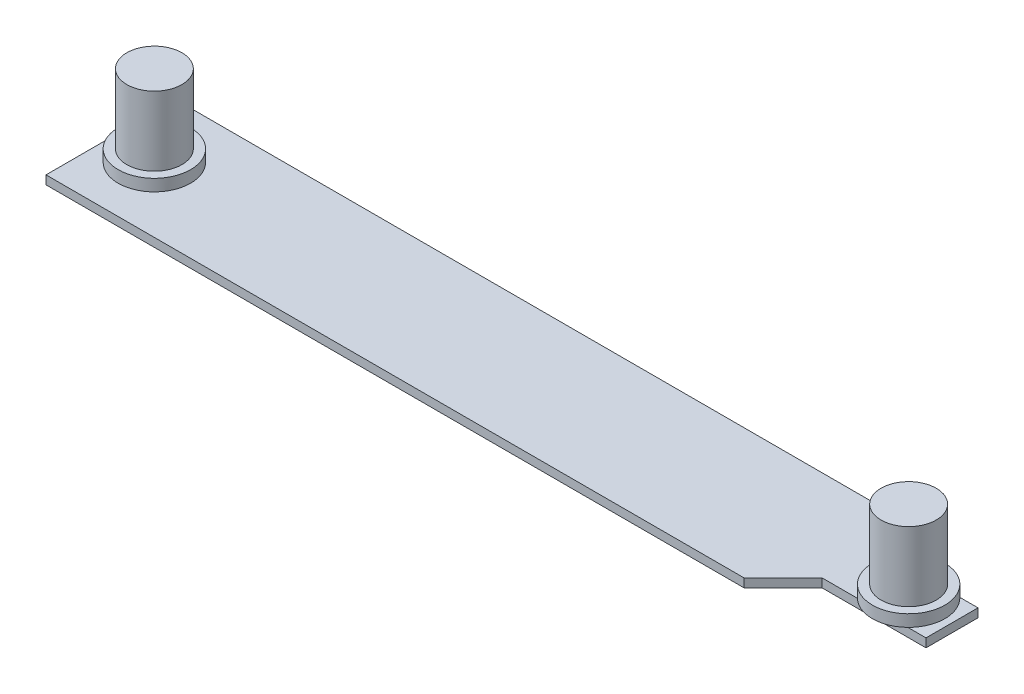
ISO-10303-21;
HEADER;
FILE_DESCRIPTION(('STEP AP214'),'2;1');
FILE_NAME('part.step','',(''),(''),'','','');
FILE_SCHEMA(('AUTOMOTIVE_DESIGN { 1 0 10303 214 1 1 1 1 }'));
ENDSEC;
DATA;
#1=APPLICATION_CONTEXT('core data for automotive mechanical design processes');
#2=APPLICATION_PROTOCOL_DEFINITION('international standard','automotive_design',2000,#1);
#3=PRODUCT_CONTEXT('',#1,'mechanical');
#4=PRODUCT('Part','Part','',(#3));
#5=PRODUCT_RELATED_PRODUCT_CATEGORY('part','',(#4));
#6=PRODUCT_DEFINITION_FORMATION('','',#4);
#7=PRODUCT_DEFINITION_CONTEXT('part definition',#1,'design');
#8=PRODUCT_DEFINITION('design','',#6,#7);
#9=PRODUCT_DEFINITION_SHAPE('','',#8);
#10=(LENGTH_UNIT() NAMED_UNIT(*) SI_UNIT(.MILLI.,.METRE.));
#11=(NAMED_UNIT(*) PLANE_ANGLE_UNIT() SI_UNIT($,.RADIAN.));
#12=(NAMED_UNIT(*) SI_UNIT($,.STERADIAN.) SOLID_ANGLE_UNIT());
#13=UNCERTAINTY_MEASURE_WITH_UNIT(LENGTH_MEASURE(1.E-05),#10,'distance_accuracy_value','');
#14=(GEOMETRIC_REPRESENTATION_CONTEXT(3) GLOBAL_UNCERTAINTY_ASSIGNED_CONTEXT((#13)) GLOBAL_UNIT_ASSIGNED_CONTEXT((#10,
#11,#12)) REPRESENTATION_CONTEXT('',''));
#15=CARTESIAN_POINT('',(0.,0.,0.));
#16=DIRECTION('',(0.,0.,1.));
#17=DIRECTION('',(1.,0.,0.));
#18=AXIS2_PLACEMENT_3D('',#15,#16,#17);
#19=CARTESIAN_POINT('',(43.5,2.36,0.));
#20=DIRECTION('',(0.,1.,0.));
#21=DIRECTION('',(0.,0.,1.));
#22=AXIS2_PLACEMENT_3D('',#19,#20,#21);
#23=PLANE('',#22);
#24=CARTESIAN_POINT('',(43.5,2.36,0.));
#25=DIRECTION('',(0.,1.,0.));
#26=DIRECTION('',(0.,0.,1.));
#27=AXIS2_PLACEMENT_3D('',#24,#25,#26);
#28=CIRCLE('',#27,4.18);
#29=CARTESIAN_POINT('',(43.5,2.36,4.18));
#30=VERTEX_POINT('',#29);
#31=EDGE_CURVE('E139',#30,#30,#28,.T.);
#32=ORIENTED_EDGE('',*,*,#31,.T.);
#33=EDGE_LOOP('',(#32));
#34=FACE_BOUND('',#33,.T.);
#35=CARTESIAN_POINT('',(43.5,2.36,0.));
#36=DIRECTION('',(0.,1.,0.));
#37=DIRECTION('',(0.,0.,1.));
#38=AXIS2_PLACEMENT_3D('',#35,#36,#37);
#39=CIRCLE('',#38,3.18);
#40=CARTESIAN_POINT('',(43.5,2.36,3.18));
#41=VERTEX_POINT('',#40);
#42=EDGE_CURVE('E226',#41,#41,#39,.T.);
#43=ORIENTED_EDGE('',*,*,#42,.F.);
#44=EDGE_LOOP('',(#43));
#45=FACE_BOUND('',#44,.T.);
#46=ADVANCED_FACE('F33',(#34,#45),#23,.T.);
#47=CARTESIAN_POINT('',(-43.5,2.36,0.));
#48=DIRECTION('',(0.,1.,0.));
#49=DIRECTION('',(0.,0.,1.));
#50=AXIS2_PLACEMENT_3D('',#47,#48,#49);
#51=PLANE('',#50);
#52=CARTESIAN_POINT('',(-43.5,2.36,0.));
#53=DIRECTION('',(0.,1.,0.));
#54=DIRECTION('',(0.,0.,1.));
#55=AXIS2_PLACEMENT_3D('',#52,#53,#54);
#56=CIRCLE('',#55,4.18);
#57=CARTESIAN_POINT('',(-43.5,2.36,4.18));
#58=VERTEX_POINT('',#57);
#59=EDGE_CURVE('E144',#58,#58,#56,.T.);
#60=ORIENTED_EDGE('',*,*,#59,.T.);
#61=EDGE_LOOP('',(#60));
#62=FACE_BOUND('',#61,.T.);
#63=CARTESIAN_POINT('',(-43.5,2.36,0.));
#64=DIRECTION('',(0.,1.,0.));
#65=DIRECTION('',(0.,0.,1.));
#66=AXIS2_PLACEMENT_3D('',#63,#64,#65);
#67=CIRCLE('',#66,3.18);
#68=CARTESIAN_POINT('',(-43.5,2.36,3.18000000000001));
#69=VERTEX_POINT('',#68);
#70=EDGE_CURVE('E219',#69,#69,#67,.T.);
#71=ORIENTED_EDGE('',*,*,#70,.F.);
#72=EDGE_LOOP('',(#71));
#73=FACE_BOUND('',#72,.T.);
#74=ADVANCED_FACE('F242',(#62,#73),#51,.T.);
#75=CARTESIAN_POINT('',(0.,1.,0.));
#76=DIRECTION('',(0.,-1.,0.));
#77=DIRECTION('',(0.,0.,-1.));
#78=AXIS2_PLACEMENT_3D('',#75,#76,#77);
#79=PLANE('',#78);
#80=CARTESIAN_POINT('',(-43.5,1.,0.));
#81=DIRECTION('',(0.,-1.,0.));
#82=DIRECTION('',(0.,0.,-1.));
#83=AXIS2_PLACEMENT_3D('',#80,#81,#82);
#84=CIRCLE('',#83,4.18);
#85=CARTESIAN_POINT('',(-43.5,1.,-4.18));
#86=VERTEX_POINT('',#85);
#87=EDGE_CURVE('E11',#86,#86,#84,.F.);
#88=ORIENTED_EDGE('',*,*,#87,.F.);
#89=EDGE_LOOP('',(#88));
#90=FACE_BOUND('',#89,.T.);
#91=CARTESIAN_POINT('',(43.5,1.,0.));
#92=DIRECTION('',(0.,1.,0.));
#93=DIRECTION('',(0.,0.,1.));
#94=AXIS2_PLACEMENT_3D('',#91,#92,#93);
#95=CIRCLE('',#94,4.18);
#96=CARTESIAN_POINT('',(40.5892612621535,1.,-2.99999999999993));
#97=VERTEX_POINT('',#96);
#98=CARTESIAN_POINT('',(40.5892612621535,1.,2.99999999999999));
#99=VERTEX_POINT('',#98);
#100=EDGE_CURVE('E124',#97,#99,#95,.T.);
#101=ORIENTED_EDGE('',*,*,#100,.F.);
#102=DIRECTION('',(-1.,0.,0.));
#103=VECTOR('',#102,1.);
#104=CARTESIAN_POINT('',(48.5,1.,-3.00000000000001));
#105=LINE('',#104,#103);
#106=CARTESIAN_POINT('',(36.4999999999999,1.,-2.9999999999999));
#107=VERTEX_POINT('',#106);
#108=EDGE_CURVE('E110',#97,#107,#105,.T.);
#109=ORIENTED_EDGE('',*,*,#108,.T.);
#110=DIRECTION('',(-0.707106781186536,0.,-0.70710678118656));
#111=VECTOR('',#110,1.);
#112=CARTESIAN_POINT('',(36.4999999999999,1.,-2.9999999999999));
#113=LINE('',#112,#111);
#114=CARTESIAN_POINT('',(31.9999999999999,1.,-7.50000000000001));
#115=VERTEX_POINT('',#114);
#116=EDGE_CURVE('E154',#107,#115,#113,.T.);
#117=ORIENTED_EDGE('',*,*,#116,.T.);
#118=DIRECTION('',(-1.,0.,0.));
#119=VECTOR('',#118,1.);
#120=CARTESIAN_POINT('',(31.9999999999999,1.,-7.50000000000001));
#121=LINE('',#120,#119);
#122=CARTESIAN_POINT('',(-48.5,1.,-7.50000000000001));
#123=VERTEX_POINT('',#122);
#124=EDGE_CURVE('E156',#115,#123,#121,.T.);
#125=ORIENTED_EDGE('',*,*,#124,.T.);
#126=DIRECTION('',(0.,0.,1.));
#127=VECTOR('',#126,1.);
#128=CARTESIAN_POINT('',(-48.5,1.,7.5000000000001));
#129=LINE('',#128,#127);
#130=CARTESIAN_POINT('',(-48.5,1.,7.5000000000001));
#131=VERTEX_POINT('',#130);
#132=EDGE_CURVE('E158',#123,#131,#129,.T.);
#133=ORIENTED_EDGE('',*,*,#132,.T.);
#134=DIRECTION('',(1.,0.,0.));
#135=VECTOR('',#134,1.);
#136=CARTESIAN_POINT('',(31.9999999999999,1.,7.5000000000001));
#137=LINE('',#136,#135);
#138=CARTESIAN_POINT('',(31.9999999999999,1.,7.5000000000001));
#139=VERTEX_POINT('',#138);
#140=EDGE_CURVE('E160',#131,#139,#137,.T.);
#141=ORIENTED_EDGE('',*,*,#140,.T.);
#142=DIRECTION('',(0.707106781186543,0.,-0.707106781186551));
#143=VECTOR('',#142,1.);
#144=CARTESIAN_POINT('',(36.5,1.,2.99999999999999));
#145=LINE('',#144,#143);
#146=CARTESIAN_POINT('',(36.5,1.,2.99999999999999));
#147=VERTEX_POINT('',#146);
#148=EDGE_CURVE('E148',#139,#147,#145,.T.);
#149=ORIENTED_EDGE('',*,*,#148,.T.);
#150=DIRECTION('',(1.,0.,0.));
#151=VECTOR('',#150,1.);
#152=CARTESIAN_POINT('',(48.5,1.,2.99999999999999));
#153=LINE('',#152,#151);
#154=EDGE_CURVE('E127',#147,#99,#153,.T.);
#155=ORIENTED_EDGE('',*,*,#154,.T.);
#156=EDGE_LOOP('',(#101,#109,#117,#125,#133,#141,#149,#155));
#157=FACE_BOUND('',#156,.T.);
#158=ADVANCED_FACE('F125',(#90,#157),#79,.F.);
#159=CARTESIAN_POINT('',(46.4107387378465,1.,2.99999999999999));
#160=VERTEX_POINT('',#159);
#161=CARTESIAN_POINT('',(46.4107387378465,1.,-2.99999999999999));
#162=VERTEX_POINT('',#161);
#163=EDGE_CURVE('E48',#160,#162,#95,.T.);
#164=ORIENTED_EDGE('',*,*,#163,.F.);
#165=CARTESIAN_POINT('',(48.5,1.,2.99999999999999));
#166=VERTEX_POINT('',#165);
#167=EDGE_CURVE('E150',#160,#166,#153,.T.);
#168=ORIENTED_EDGE('',*,*,#167,.T.);
#169=DIRECTION('',(0.,0.,-1.));
#170=VECTOR('',#169,1.);
#171=CARTESIAN_POINT('',(48.5,1.,2.99999999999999));
#172=LINE('',#171,#170);
#173=CARTESIAN_POINT('',(48.5,1.,-3.00000000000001));
#174=VERTEX_POINT('',#173);
#175=EDGE_CURVE('E120',#166,#174,#172,.T.);
#176=ORIENTED_EDGE('',*,*,#175,.T.);
#177=EDGE_CURVE('E122',#174,#162,#105,.T.);
#178=ORIENTED_EDGE('',*,*,#177,.T.);
#179=EDGE_LOOP('',(#164,#168,#176,#178));
#180=FACE_BOUND('',#179,.T.);
#181=ADVANCED_FACE('F214',(#180),#79,.F.);
#182=CARTESIAN_POINT('',(36.5,1.,2.99999999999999));
#183=DIRECTION('',(-0.707106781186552,0.,-0.707106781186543));
#184=DIRECTION('',(-0.707106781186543,0.,0.707106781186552));
#185=AXIS2_PLACEMENT_3D('',#182,#183,#184);
#186=PLANE('',#185);
#187=DIRECTION('',(0.707106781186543,0.,-0.707106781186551));
#188=VECTOR('',#187,1.);
#189=CARTESIAN_POINT('',(36.5,0.,2.99999999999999));
#190=LINE('',#189,#188);
#191=CARTESIAN_POINT('',(31.9999999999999,0.,7.5000000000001));
#192=VERTEX_POINT('',#191);
#193=CARTESIAN_POINT('',(36.5,0.,2.99999999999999));
#194=VERTEX_POINT('',#193);
#195=EDGE_CURVE('E147',#192,#194,#190,.T.);
#196=ORIENTED_EDGE('',*,*,#195,.T.);
#197=DIRECTION('',(0.,-1.,0.));
#198=VECTOR('',#197,1.);
#199=CARTESIAN_POINT('',(36.5,1.,2.99999999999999));
#200=LINE('',#199,#198);
#201=EDGE_CURVE('E41',#147,#194,#200,.T.);
#202=ORIENTED_EDGE('',*,*,#201,.F.);
#203=ORIENTED_EDGE('',*,*,#148,.F.);
#204=DIRECTION('',(0.,-1.,0.));
#205=VECTOR('',#204,1.);
#206=CARTESIAN_POINT('',(31.9999999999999,1.,7.5000000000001));
#207=LINE('',#206,#205);
#208=EDGE_CURVE('E162',#139,#192,#207,.T.);
#209=ORIENTED_EDGE('',*,*,#208,.T.);
#210=EDGE_LOOP('',(#196,#202,#203,#209));
#211=FACE_BOUND('',#210,.T.);
#212=ADVANCED_FACE('F35',(#211),#186,.F.);
#213=CARTESIAN_POINT('',(48.5,1.,2.99999999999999));
#214=DIRECTION('',(0.,0.,-1.));
#215=DIRECTION('',(-1.,0.,0.));
#216=AXIS2_PLACEMENT_3D('',#213,#214,#215);
#217=PLANE('',#216);
#218=DIRECTION('',(1.,0.,0.));
#219=VECTOR('',#218,1.);
#220=CARTESIAN_POINT('',(48.5,0.,2.99999999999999));
#221=LINE('',#220,#219);
#222=CARTESIAN_POINT('',(48.5,0.,2.99999999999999));
#223=VERTEX_POINT('',#222);
#224=EDGE_CURVE('E165',#194,#223,#221,.T.);
#225=ORIENTED_EDGE('',*,*,#224,.T.);
#226=DIRECTION('',(0.,-1.,0.));
#227=VECTOR('',#226,1.);
#228=CARTESIAN_POINT('',(48.5,1.,2.99999999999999));
#229=LINE('',#228,#227);
#230=EDGE_CURVE('E193',#166,#223,#229,.T.);
#231=ORIENTED_EDGE('',*,*,#230,.F.);
#232=ORIENTED_EDGE('',*,*,#167,.F.);
#233=DIRECTION('',(1.,0.,0.));
#234=VECTOR('',#233,1.);
#235=CARTESIAN_POINT('',(48.5,1.,2.99999999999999));
#236=LINE('',#235,#234);
#237=EDGE_CURVE('E55',#99,#160,#236,.T.);
#238=ORIENTED_EDGE('',*,*,#237,.F.);
#239=ORIENTED_EDGE('',*,*,#154,.F.);
#240=ORIENTED_EDGE('',*,*,#201,.T.);
#241=EDGE_LOOP('',(#225,#231,#232,#238,#239,#240));
#242=FACE_BOUND('',#241,.T.);
#243=ADVANCED_FACE('F197',(#242),#217,.F.);
#244=CARTESIAN_POINT('',(48.5,1.,2.99999999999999));
#245=DIRECTION('',(-1.,0.,0.));
#246=DIRECTION('',(0.,0.,1.));
#247=AXIS2_PLACEMENT_3D('',#244,#245,#246);
#248=PLANE('',#247);
#249=DIRECTION('',(0.,0.,-1.));
#250=VECTOR('',#249,1.);
#251=CARTESIAN_POINT('',(48.5,0.,2.99999999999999));
#252=LINE('',#251,#250);
#253=CARTESIAN_POINT('',(48.5,0.,-3.00000000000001));
#254=VERTEX_POINT('',#253);
#255=EDGE_CURVE('E167',#223,#254,#252,.T.);
#256=ORIENTED_EDGE('',*,*,#255,.T.);
#257=DIRECTION('',(0.,-1.,0.));
#258=VECTOR('',#257,1.);
#259=CARTESIAN_POINT('',(48.5,1.,-3.00000000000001));
#260=LINE('',#259,#258);
#261=EDGE_CURVE('E190',#174,#254,#260,.T.);
#262=ORIENTED_EDGE('',*,*,#261,.F.);
#263=ORIENTED_EDGE('',*,*,#175,.F.);
#264=ORIENTED_EDGE('',*,*,#230,.T.);
#265=EDGE_LOOP('',(#256,#262,#263,#264));
#266=FACE_BOUND('',#265,.T.);
#267=ADVANCED_FACE('F212',(#266),#248,.F.);
#268=CARTESIAN_POINT('',(48.5,1.,-3.00000000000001));
#269=DIRECTION('',(0.,0.,1.));
#270=DIRECTION('',(1.,0.,0.));
#271=AXIS2_PLACEMENT_3D('',#268,#269,#270);
#272=PLANE('',#271);
#273=DIRECTION('',(-1.,0.,0.));
#274=VECTOR('',#273,1.);
#275=CARTESIAN_POINT('',(48.5,0.,-3.00000000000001));
#276=LINE('',#275,#274);
#277=CARTESIAN_POINT('',(36.4999999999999,0.,-2.9999999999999));
#278=VERTEX_POINT('',#277);
#279=EDGE_CURVE('E169',#254,#278,#276,.T.);
#280=ORIENTED_EDGE('',*,*,#279,.T.);
#281=DIRECTION('',(0.,-1.,0.));
#282=VECTOR('',#281,1.);
#283=CARTESIAN_POINT('',(36.4999999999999,1.,-2.9999999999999));
#284=LINE('',#283,#282);
#285=EDGE_CURVE('E117',#107,#278,#284,.T.);
#286=ORIENTED_EDGE('',*,*,#285,.F.);
#287=ORIENTED_EDGE('',*,*,#108,.F.);
#288=EDGE_CURVE('E115',#162,#97,#105,.T.);
#289=ORIENTED_EDGE('',*,*,#288,.F.);
#290=ORIENTED_EDGE('',*,*,#177,.F.);
#291=ORIENTED_EDGE('',*,*,#261,.T.);
#292=EDGE_LOOP('',(#280,#286,#287,#289,#290,#291));
#293=FACE_BOUND('',#292,.T.);
#294=ADVANCED_FACE('F112',(#293),#272,.F.);
#295=CARTESIAN_POINT('',(36.4999999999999,1.,-2.9999999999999));
#296=DIRECTION('',(-0.70710678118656,0.,0.707106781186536));
#297=DIRECTION('',(0.707106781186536,0.,0.70710678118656));
#298=AXIS2_PLACEMENT_3D('',#295,#296,#297);
#299=PLANE('',#298);
#300=DIRECTION('',(-0.707106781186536,0.,-0.70710678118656));
#301=VECTOR('',#300,1.);
#302=CARTESIAN_POINT('',(36.4999999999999,0.,-2.9999999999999));
#303=LINE('',#302,#301);
#304=CARTESIAN_POINT('',(31.9999999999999,0.,-7.50000000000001));
#305=VERTEX_POINT('',#304);
#306=EDGE_CURVE('E171',#278,#305,#303,.T.);
#307=ORIENTED_EDGE('',*,*,#306,.T.);
#308=DIRECTION('',(0.,-1.,0.));
#309=VECTOR('',#308,1.);
#310=CARTESIAN_POINT('',(31.9999999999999,1.,-7.50000000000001));
#311=LINE('',#310,#309);
#312=EDGE_CURVE('E186',#115,#305,#311,.T.);
#313=ORIENTED_EDGE('',*,*,#312,.F.);
#314=ORIENTED_EDGE('',*,*,#116,.F.);
#315=ORIENTED_EDGE('',*,*,#285,.T.);
#316=EDGE_LOOP('',(#307,#313,#314,#315));
#317=FACE_BOUND('',#316,.T.);
#318=ADVANCED_FACE('F280',(#317),#299,.F.);
#319=CARTESIAN_POINT('',(31.9999999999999,1.,-7.50000000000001));
#320=DIRECTION('',(0.,0.,1.));
#321=DIRECTION('',(1.,0.,0.));
#322=AXIS2_PLACEMENT_3D('',#319,#320,#321);
#323=PLANE('',#322);
#324=DIRECTION('',(-1.,0.,0.));
#325=VECTOR('',#324,1.);
#326=CARTESIAN_POINT('',(31.9999999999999,0.,-7.50000000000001));
#327=LINE('',#326,#325);
#328=CARTESIAN_POINT('',(-48.5,0.,-7.50000000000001));
#329=VERTEX_POINT('',#328);
#330=EDGE_CURVE('E173',#305,#329,#327,.T.);
#331=ORIENTED_EDGE('',*,*,#330,.T.);
#332=DIRECTION('',(0.,-1.,0.));
#333=VECTOR('',#332,1.);
#334=CARTESIAN_POINT('',(-48.5,1.,-7.50000000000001));
#335=LINE('',#334,#333);
#336=EDGE_CURVE('E183',#123,#329,#335,.T.);
#337=ORIENTED_EDGE('',*,*,#336,.F.);
#338=ORIENTED_EDGE('',*,*,#124,.F.);
#339=ORIENTED_EDGE('',*,*,#312,.T.);
#340=EDGE_LOOP('',(#331,#337,#338,#339));
#341=FACE_BOUND('',#340,.T.);
#342=ADVANCED_FACE('F276',(#341),#323,.F.);
#343=CARTESIAN_POINT('',(-48.5,1.,7.5000000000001));
#344=DIRECTION('',(1.,0.,0.));
#345=DIRECTION('',(0.,0.,-1.));
#346=AXIS2_PLACEMENT_3D('',#343,#344,#345);
#347=PLANE('',#346);
#348=DIRECTION('',(0.,0.,1.));
#349=VECTOR('',#348,1.);
#350=CARTESIAN_POINT('',(-48.5,0.,7.5000000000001));
#351=LINE('',#350,#349);
#352=CARTESIAN_POINT('',(-48.5,0.,7.5000000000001));
#353=VERTEX_POINT('',#352);
#354=EDGE_CURVE('E175',#329,#353,#351,.T.);
#355=ORIENTED_EDGE('',*,*,#354,.T.);
#356=DIRECTION('',(0.,-1.,0.));
#357=VECTOR('',#356,1.);
#358=CARTESIAN_POINT('',(-48.5,1.,7.5000000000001));
#359=LINE('',#358,#357);
#360=EDGE_CURVE('E180',#131,#353,#359,.T.);
#361=ORIENTED_EDGE('',*,*,#360,.F.);
#362=ORIENTED_EDGE('',*,*,#132,.F.);
#363=ORIENTED_EDGE('',*,*,#336,.T.);
#364=EDGE_LOOP('',(#355,#361,#362,#363));
#365=FACE_BOUND('',#364,.T.);
#366=ADVANCED_FACE('F272',(#365),#347,.F.);
#367=CARTESIAN_POINT('',(31.9999999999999,1.,7.5000000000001));
#368=DIRECTION('',(0.,0.,-1.));
#369=DIRECTION('',(-1.,0.,0.));
#370=AXIS2_PLACEMENT_3D('',#367,#368,#369);
#371=PLANE('',#370);
#372=DIRECTION('',(1.,0.,0.));
#373=VECTOR('',#372,1.);
#374=CARTESIAN_POINT('',(31.9999999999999,0.,7.5000000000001));
#375=LINE('',#374,#373);
#376=EDGE_CURVE('E151',#353,#192,#375,.T.);
#377=ORIENTED_EDGE('',*,*,#376,.T.);
#378=ORIENTED_EDGE('',*,*,#208,.F.);
#379=ORIENTED_EDGE('',*,*,#140,.F.);
#380=ORIENTED_EDGE('',*,*,#360,.T.);
#381=EDGE_LOOP('',(#377,#378,#379,#380));
#382=FACE_BOUND('',#381,.T.);
#383=ADVANCED_FACE('F269',(#382),#371,.F.);
#384=CARTESIAN_POINT('',(0.,0.,0.));
#385=DIRECTION('',(0.,-1.,0.));
#386=DIRECTION('',(0.,0.,-1.));
#387=AXIS2_PLACEMENT_3D('',#384,#385,#386);
#388=PLANE('',#387);
#389=ORIENTED_EDGE('',*,*,#195,.F.);
#390=ORIENTED_EDGE('',*,*,#376,.F.);
#391=ORIENTED_EDGE('',*,*,#354,.F.);
#392=ORIENTED_EDGE('',*,*,#330,.F.);
#393=ORIENTED_EDGE('',*,*,#306,.F.);
#394=ORIENTED_EDGE('',*,*,#279,.F.);
#395=ORIENTED_EDGE('',*,*,#255,.F.);
#396=ORIENTED_EDGE('',*,*,#224,.F.);
#397=EDGE_LOOP('',(#389,#390,#391,#392,#393,#394,#395,#396));
#398=FACE_BOUND('',#397,.T.);
#399=ADVANCED_FACE('F205',(#398),#388,.T.);
#400=CARTESIAN_POINT('',(-43.5,2.36,0.));
#401=DIRECTION('',(0.,-1.,0.));
#402=DIRECTION('',(0.,0.,-1.));
#403=AXIS2_PLACEMENT_3D('',#400,#401,#402);
#404=CYLINDRICAL_SURFACE('',#403,4.18);
#405=ORIENTED_EDGE('',*,*,#59,.F.);
#406=EDGE_LOOP('',(#405));
#407=FACE_BOUND('',#406,.T.);
#408=ORIENTED_EDGE('',*,*,#87,.T.);
#409=EDGE_LOOP('',(#408));
#410=FACE_BOUND('',#409,.T.);
#411=ADVANCED_FACE('F257',(#407,#410),#404,.T.);
#412=CARTESIAN_POINT('',(43.5,1.,0.));
#413=DIRECTION('',(0.,1.,0.));
#414=DIRECTION('',(0.,0.,1.));
#415=AXIS2_PLACEMENT_3D('',#412,#413,#414);
#416=PLANE('',#415);
#417=EDGE_CURVE('E133',#99,#160,#95,.T.);
#418=ORIENTED_EDGE('',*,*,#417,.F.);
#419=ORIENTED_EDGE('',*,*,#237,.T.);
#420=EDGE_LOOP('',(#418,#419));
#421=FACE_BOUND('',#420,.T.);
#422=ADVANCED_FACE('F216',(#421),#416,.F.);
#423=EDGE_CURVE('E132',#162,#97,#95,.T.);
#424=ORIENTED_EDGE('',*,*,#423,.F.);
#425=ORIENTED_EDGE('',*,*,#288,.T.);
#426=EDGE_LOOP('',(#424,#425));
#427=FACE_BOUND('',#426,.T.);
#428=ADVANCED_FACE('F137',(#427),#416,.F.);
#429=CARTESIAN_POINT('',(43.5,2.36,0.));
#430=DIRECTION('',(0.,-1.,0.));
#431=DIRECTION('',(0.,0.,-1.));
#432=AXIS2_PLACEMENT_3D('',#429,#430,#431);
#433=CYLINDRICAL_SURFACE('',#432,4.18);
#434=ORIENTED_EDGE('',*,*,#31,.F.);
#435=EDGE_LOOP('',(#434));
#436=FACE_BOUND('',#435,.T.);
#437=ORIENTED_EDGE('',*,*,#163,.T.);
#438=ORIENTED_EDGE('',*,*,#423,.T.);
#439=ORIENTED_EDGE('',*,*,#100,.T.);
#440=ORIENTED_EDGE('',*,*,#417,.T.);
#441=EDGE_LOOP('',(#437,#438,#439,#440));
#442=FACE_BOUND('',#441,.T.);
#443=ADVANCED_FACE('F138',(#436,#442),#433,.T.);
#444=CARTESIAN_POINT('',(-43.5,10.36,0.));
#445=DIRECTION('',(0.,-1.,0.));
#446=DIRECTION('',(0.,0.,-1.));
#447=AXIS2_PLACEMENT_3D('',#444,#445,#446);
#448=CYLINDRICAL_SURFACE('',#447,3.18);
#449=CARTESIAN_POINT('',(-43.5,10.36,0.));
#450=DIRECTION('',(0.,1.,0.));
#451=DIRECTION('',(0.,0.,1.));
#452=AXIS2_PLACEMENT_3D('',#449,#450,#451);
#453=CIRCLE('',#452,3.18);
#454=CARTESIAN_POINT('',(-43.5,10.36,3.18000000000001));
#455=VERTEX_POINT('',#454);
#456=EDGE_CURVE('E217',#455,#455,#453,.T.);
#457=ORIENTED_EDGE('',*,*,#456,.F.);
#458=EDGE_LOOP('',(#457));
#459=FACE_BOUND('',#458,.T.);
#460=ORIENTED_EDGE('',*,*,#70,.T.);
#461=EDGE_LOOP('',(#460));
#462=FACE_BOUND('',#461,.T.);
#463=ADVANCED_FACE('F253',(#459,#462),#448,.T.);
#464=CARTESIAN_POINT('',(-43.5,10.36,0.));
#465=DIRECTION('',(0.,1.,0.));
#466=DIRECTION('',(0.,0.,1.));
#467=AXIS2_PLACEMENT_3D('',#464,#465,#466);
#468=PLANE('',#467);
#469=ORIENTED_EDGE('',*,*,#456,.T.);
#470=EDGE_LOOP('',(#469));
#471=FACE_BOUND('',#470,.T.);
#472=ADVANCED_FACE('F237',(#471),#468,.T.);
#473=CARTESIAN_POINT('',(43.5,10.36,0.));
#474=DIRECTION('',(0.,-1.,0.));
#475=DIRECTION('',(0.,0.,-1.));
#476=AXIS2_PLACEMENT_3D('',#473,#474,#475);
#477=CYLINDRICAL_SURFACE('',#476,3.18);
#478=CARTESIAN_POINT('',(43.5,10.36,0.));
#479=DIRECTION('',(0.,1.,0.));
#480=DIRECTION('',(0.,0.,1.));
#481=AXIS2_PLACEMENT_3D('',#478,#479,#480);
#482=CIRCLE('',#481,3.18);
#483=CARTESIAN_POINT('',(43.5,10.36,3.18));
#484=VERTEX_POINT('',#483);
#485=EDGE_CURVE('E224',#484,#484,#482,.T.);
#486=ORIENTED_EDGE('',*,*,#485,.F.);
#487=EDGE_LOOP('',(#486));
#488=FACE_BOUND('',#487,.T.);
#489=ORIENTED_EDGE('',*,*,#42,.T.);
#490=EDGE_LOOP('',(#489));
#491=FACE_BOUND('',#490,.T.);
#492=ADVANCED_FACE('F234',(#488,#491),#477,.T.);
#493=CARTESIAN_POINT('',(43.5,10.36,0.));
#494=DIRECTION('',(0.,1.,0.));
#495=DIRECTION('',(0.,0.,1.));
#496=AXIS2_PLACEMENT_3D('',#493,#494,#495);
#497=PLANE('',#496);
#498=ORIENTED_EDGE('',*,*,#485,.T.);
#499=EDGE_LOOP('',(#498));
#500=FACE_BOUND('',#499,.T.);
#501=ADVANCED_FACE('F232',(#500),#497,.T.);
#502=CLOSED_SHELL('',(#46,#74,#158,#181,#212,#243,#267,#294,#318,#342,#366,#383,#399,#411,#422,
#428,#443,#463,#472,#492,#501));
#503=MANIFOLD_SOLID_BREP('B2',#502);
#504=ADVANCED_BREP_SHAPE_REPRESENTATION('',(#18,#503),#14);
#505=SHAPE_DEFINITION_REPRESENTATION(#9,#504);
ENDSEC;
END-ISO-10303-21;
